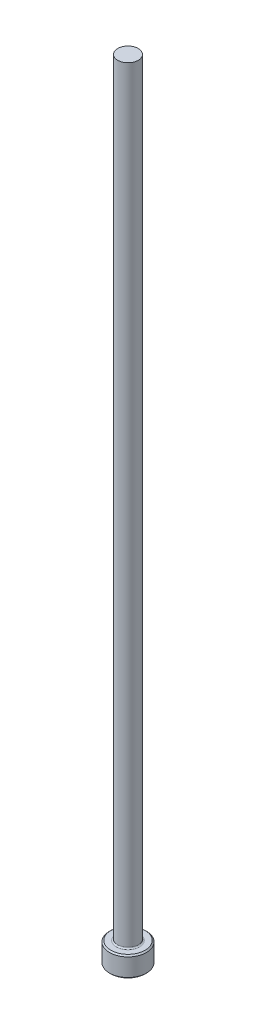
ISO-10303-21;
HEADER;
FILE_DESCRIPTION(('STEP AP214'),'2;1');
FILE_NAME('part.step','',(''),(''),'','','');
FILE_SCHEMA(('AUTOMOTIVE_DESIGN { 1 0 10303 214 1 1 1 1 }'));
ENDSEC;
DATA;
#1=APPLICATION_CONTEXT('core data for automotive mechanical design processes');
#2=APPLICATION_PROTOCOL_DEFINITION('international standard','automotive_design',2000,#1);
#3=PRODUCT_CONTEXT('',#1,'mechanical');
#4=PRODUCT('Part','Part','',(#3));
#5=PRODUCT_RELATED_PRODUCT_CATEGORY('part','',(#4));
#6=PRODUCT_DEFINITION_FORMATION('','',#4);
#7=PRODUCT_DEFINITION_CONTEXT('part definition',#1,'design');
#8=PRODUCT_DEFINITION('design','',#6,#7);
#9=PRODUCT_DEFINITION_SHAPE('','',#8);
#10=(LENGTH_UNIT() NAMED_UNIT(*) SI_UNIT(.MILLI.,.METRE.));
#11=(NAMED_UNIT(*) PLANE_ANGLE_UNIT() SI_UNIT($,.RADIAN.));
#12=(NAMED_UNIT(*) SI_UNIT($,.STERADIAN.) SOLID_ANGLE_UNIT());
#13=UNCERTAINTY_MEASURE_WITH_UNIT(LENGTH_MEASURE(1.E-05),#10,'distance_accuracy_value','');
#14=(GEOMETRIC_REPRESENTATION_CONTEXT(3) GLOBAL_UNCERTAINTY_ASSIGNED_CONTEXT((#13)) GLOBAL_UNIT_ASSIGNED_CONTEXT((#10,
#11,#12)) REPRESENTATION_CONTEXT('',''));
#15=CARTESIAN_POINT('',(0.,0.,0.));
#16=DIRECTION('',(0.,0.,1.));
#17=DIRECTION('',(1.,0.,0.));
#18=AXIS2_PLACEMENT_3D('',#15,#16,#17);
#19=CARTESIAN_POINT('',(0.,0.,0.));
#20=DIRECTION('',(0.,-1.,0.));
#21=DIRECTION('',(0.,0.,-1.));
#22=AXIS2_PLACEMENT_3D('',#19,#20,#21);
#23=PLANE('',#22);
#24=CARTESIAN_POINT('',(0.,0.,0.));
#25=DIRECTION('',(0.,-1.,0.));
#26=DIRECTION('',(0.,0.,-1.));
#27=AXIS2_PLACEMENT_3D('',#24,#25,#26);
#28=CIRCLE('',#27,3.31469999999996);
#29=CARTESIAN_POINT('',(0.,0.,-3.31469999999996));
#30=VERTEX_POINT('',#29);
#31=EDGE_CURVE('E46',#30,#30,#28,.T.);
#32=ORIENTED_EDGE('',*,*,#31,.T.);
#33=EDGE_LOOP('',(#32));
#34=FACE_BOUND('',#33,.T.);
#35=ADVANCED_FACE('F35',(#34),#23,.T.);
#36=CARTESIAN_POINT('',(0.,259.958771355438,0.));
#37=DIRECTION('',(0.,1.,0.));
#38=DIRECTION('',(0.,0.,1.));
#39=AXIS2_PLACEMENT_3D('',#36,#37,#38);
#40=CYLINDRICAL_SURFACE('',#39,3.56869999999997);
#41=CARTESIAN_POINT('',(0.,3.70839999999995,0.));
#42=DIRECTION('',(0.,1.,0.));
#43=DIRECTION('',(0.,0.,1.));
#44=AXIS2_PLACEMENT_3D('',#41,#42,#43);
#45=CIRCLE('',#44,3.56869999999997);
#46=CARTESIAN_POINT('',(0.,3.70839999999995,3.56869999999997));
#47=VERTEX_POINT('',#46);
#48=EDGE_CURVE('E50',#47,#47,#45,.F.);
#49=ORIENTED_EDGE('',*,*,#48,.T.);
#50=EDGE_LOOP('',(#49));
#51=FACE_BOUND('',#50,.T.);
#52=CARTESIAN_POINT('',(0.,0.254000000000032,0.));
#53=DIRECTION('',(0.,-1.,0.));
#54=DIRECTION('',(0.,0.,-1.));
#55=AXIS2_PLACEMENT_3D('',#52,#53,#54);
#56=CIRCLE('',#55,3.56869999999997);
#57=CARTESIAN_POINT('',(0.,0.254000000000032,-3.56869999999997));
#58=VERTEX_POINT('',#57);
#59=EDGE_CURVE('E55',#58,#58,#56,.F.);
#60=ORIENTED_EDGE('',*,*,#59,.T.);
#61=EDGE_LOOP('',(#60));
#62=FACE_BOUND('',#61,.T.);
#63=ADVANCED_FACE('F77',(#51,#62),#40,.T.);
#64=CARTESIAN_POINT('',(-3.56869999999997,3.9624,0.));
#65=DIRECTION('',(0.,1.,0.));
#66=DIRECTION('',(0.,0.,1.));
#67=AXIS2_PLACEMENT_3D('',#64,#65,#66);
#68=PLANE('',#67);
#69=CARTESIAN_POINT('',(0.,3.9624,0.));
#70=DIRECTION('',(0.,1.,0.));
#71=DIRECTION('',(0.,0.,1.));
#72=AXIS2_PLACEMENT_3D('',#69,#70,#71);
#73=CIRCLE('',#72,2.23773999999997);
#74=CARTESIAN_POINT('',(0.,3.9624,2.23773999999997));
#75=VERTEX_POINT('',#74);
#76=EDGE_CURVE('E10',#75,#75,#73,.F.);
#77=ORIENTED_EDGE('',*,*,#76,.T.);
#78=EDGE_LOOP('',(#77));
#79=FACE_BOUND('',#78,.T.);
#80=CARTESIAN_POINT('',(0.,3.9624,0.));
#81=DIRECTION('',(0.,1.,0.));
#82=DIRECTION('',(0.,0.,1.));
#83=AXIS2_PLACEMENT_3D('',#80,#81,#82);
#84=CIRCLE('',#83,3.31469999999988);
#85=CARTESIAN_POINT('',(0.,3.9624,3.31469999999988));
#86=VERTEX_POINT('',#85);
#87=EDGE_CURVE('E58',#86,#86,#84,.T.);
#88=ORIENTED_EDGE('',*,*,#87,.T.);
#89=EDGE_LOOP('',(#88));
#90=FACE_BOUND('',#89,.T.);
#91=ADVANCED_FACE('F69',(#79,#90),#68,.T.);
#92=CARTESIAN_POINT('',(0.,259.958771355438,0.));
#93=DIRECTION('',(0.,1.,0.));
#94=DIRECTION('',(0.,0.,1.));
#95=AXIS2_PLACEMENT_3D('',#92,#93,#94);
#96=CYLINDRICAL_SURFACE('',#95,1.98373999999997);
#97=CARTESIAN_POINT('',(0.,4.21640000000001,0.));
#98=DIRECTION('',(0.,1.,0.));
#99=DIRECTION('',(0.,0.,1.));
#100=AXIS2_PLACEMENT_3D('',#97,#98,#99);
#101=CIRCLE('',#100,1.98373999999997);
#102=CARTESIAN_POINT('',(0.,4.21640000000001,1.98373999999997));
#103=VERTEX_POINT('',#102);
#104=EDGE_CURVE('E42',#103,#103,#101,.T.);
#105=ORIENTED_EDGE('',*,*,#104,.T.);
#106=EDGE_LOOP('',(#105));
#107=FACE_BOUND('',#106,.T.);
#108=CARTESIAN_POINT('',(0.,152.4,0.));
#109=DIRECTION('',(0.,1.,0.));
#110=DIRECTION('',(0.,0.,1.));
#111=AXIS2_PLACEMENT_3D('',#108,#109,#110);
#112=CIRCLE('',#111,1.98373999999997);
#113=CARTESIAN_POINT('',(0.,152.4,1.98373999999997));
#114=VERTEX_POINT('',#113);
#115=EDGE_CURVE('E61',#114,#114,#112,.T.);
#116=ORIENTED_EDGE('',*,*,#115,.F.);
#117=EDGE_LOOP('',(#116));
#118=FACE_BOUND('',#117,.T.);
#119=ADVANCED_FACE('F67',(#107,#118),#96,.T.);
#120=CARTESIAN_POINT('',(-1.98373999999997,152.4,0.));
#121=DIRECTION('',(0.,1.,0.));
#122=DIRECTION('',(0.,0.,1.));
#123=AXIS2_PLACEMENT_3D('',#120,#121,#122);
#124=PLANE('',#123);
#125=ORIENTED_EDGE('',*,*,#115,.T.);
#126=EDGE_LOOP('',(#125));
#127=FACE_BOUND('',#126,.T.);
#128=ADVANCED_FACE('F65',(#127),#124,.T.);
#129=CARTESIAN_POINT('',(0.,3.96239999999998,0.));
#130=DIRECTION('',(0.,-1.,0.));
#131=DIRECTION('',(0.,0.,-1.));
#132=AXIS2_PLACEMENT_3D('',#129,#130,#131);
#133=CONICAL_SURFACE('',#132,3.31469999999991,0.785398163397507);
#134=ORIENTED_EDGE('',*,*,#48,.F.);
#135=EDGE_LOOP('',(#134));
#136=FACE_BOUND('',#135,.T.);
#137=ORIENTED_EDGE('',*,*,#87,.F.);
#138=EDGE_LOOP('',(#137));
#139=FACE_BOUND('',#138,.T.);
#140=ADVANCED_FACE('F75',(#136,#139),#133,.T.);
#141=CARTESIAN_POINT('',(0.,0.254000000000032,0.));
#142=DIRECTION('',(0.,1.,0.));
#143=DIRECTION('',(0.,0.,1.));
#144=AXIS2_PLACEMENT_3D('',#141,#142,#143);
#145=CONICAL_SURFACE('',#144,3.56869999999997,0.785398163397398);
#146=ORIENTED_EDGE('',*,*,#31,.F.);
#147=EDGE_LOOP('',(#146));
#148=FACE_BOUND('',#147,.T.);
#149=ORIENTED_EDGE('',*,*,#59,.F.);
#150=EDGE_LOOP('',(#149));
#151=FACE_BOUND('',#150,.T.);
#152=ADVANCED_FACE('F89',(#148,#151),#145,.T.);
#153=CARTESIAN_POINT('',(0.,4.21640000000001,0.));
#154=DIRECTION('',(0.,1.,0.));
#155=DIRECTION('',(0.,0.,1.));
#156=AXIS2_PLACEMENT_3D('',#153,#154,#155);
#157=TOROIDAL_SURFACE('',#156,2.23773999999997,0.254);
#158=ORIENTED_EDGE('',*,*,#76,.F.);
#159=EDGE_LOOP('',(#158));
#160=FACE_BOUND('',#159,.T.);
#161=ORIENTED_EDGE('',*,*,#104,.F.);
#162=EDGE_LOOP('',(#161));
#163=FACE_BOUND('',#162,.T.);
#164=ADVANCED_FACE('F37',(#160,#163),#157,.F.);
#165=CLOSED_SHELL('',(#35,#63,#91,#119,#128,#140,#152,#164));
#166=MANIFOLD_SOLID_BREP('B2',#165);
#167=ADVANCED_BREP_SHAPE_REPRESENTATION('',(#18,#166),#14);
#168=SHAPE_DEFINITION_REPRESENTATION(#9,#167);
ENDSEC;
END-ISO-10303-21;
